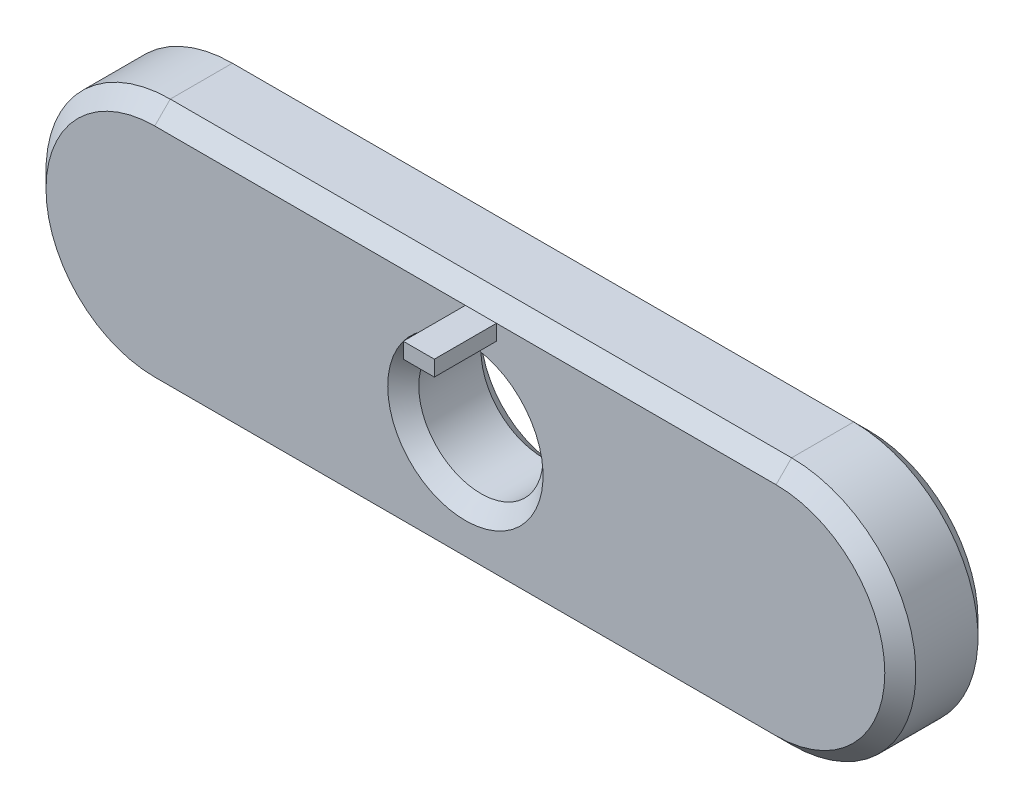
from build123d import *

# Parameters (mm, degrees)
BASE_EXTRUSION_DEPTH    = 3
ESQUISSE2_R             = 2
ENL_V_MAT_EXTRU_1_DEPTH = 3
CHANFREIN1_SIZE         = 0.5
ESQUISSE4_W             = 1
ESQUISSE4_H             = 0.5
BOSS_EXTRU_1_DEPTH      = 5


with BuildPart() as part:
    # Esquisse1 → Base-Extrusion (new body)
    with BuildSketch(Plane.XY):
        with BuildLine():
            Line((-10, 4), (10, 4))
            ThreePointArc((10, 4), (14, 0), (10, -4))
            Line((10, -4), (-10, -4))
            ThreePointArc((-10, -4), (-14, 0), (-10, 4))
        make_face()
    extrude(amount=BASE_EXTRUSION_DEPTH)

    # Esquisse2 → Enl_v. mat.-Extru.1 (cut)
    with BuildSketch(Plane.XY.offset(3)):
        with Locations(Location((0, 0, 0), (0, 0, 180))):
            Circle(ESQUISSE2_R)
    extrude(amount=-ENL_V_MAT_EXTRU_1_DEPTH, mode=Mode.SUBTRACT)

    # Chanfrein1
    chanfrein1_edges = [part.edges().sort_by_distance(p)[0] for p in [
        (0, -4, 0),
        (0, -4, 3),
        (14, 0, 0),
        (14, 0, 3),
        (-14, 0, 0),
        (-14, 0, 3),
        (0, 4, 0),
        (2, 0, 0),
        (0, 4, 3),
        (2, 0, 3),
    ]]
    chamfer(chanfrein1_edges, length=CHANFREIN1_SIZE)

    # Esquisse4 → Boss.-Extru.1 (add)
    with BuildSketch(Plane.XY):
        with Locations((0.5, 3.25)):
            Rectangle(ESQUISSE4_W, ESQUISSE4_H)
    extrude(amount=BOSS_EXTRU_1_DEPTH)


solid = part.part
